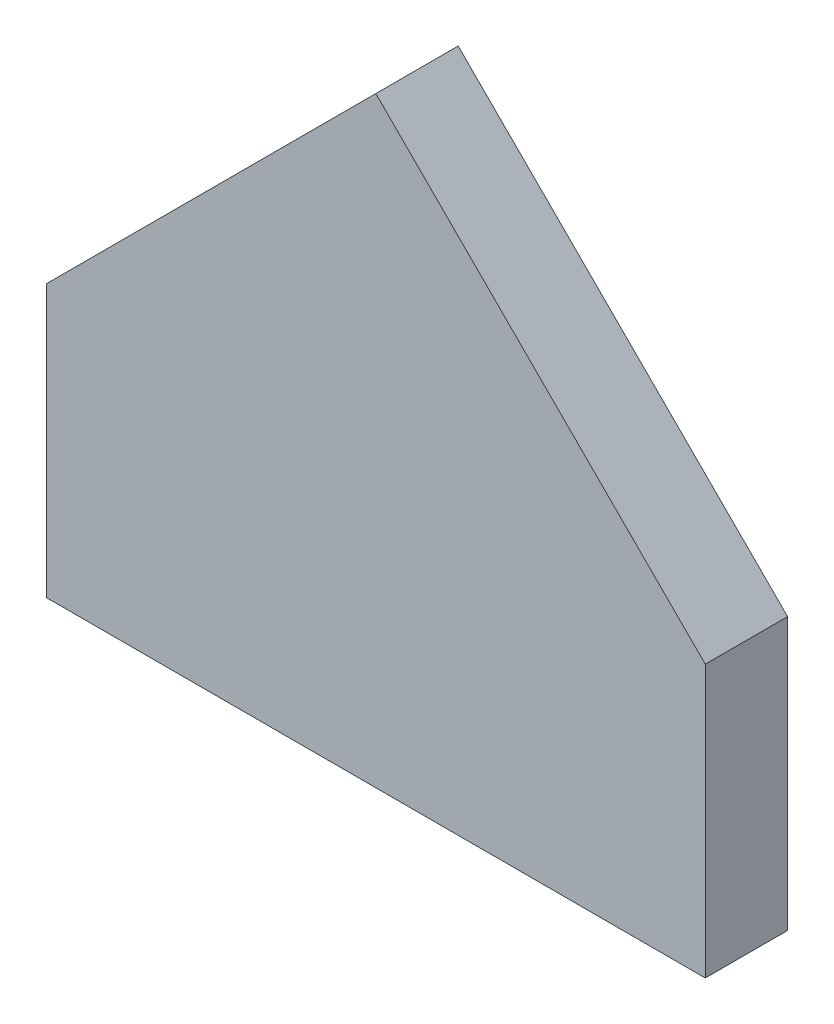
ISO-10303-21;
HEADER;
FILE_DESCRIPTION(('STEP AP214'),'2;1');
FILE_NAME('part.step','',(''),(''),'','','');
FILE_SCHEMA(('AUTOMOTIVE_DESIGN { 1 0 10303 214 1 1 1 1 }'));
ENDSEC;
DATA;
#1=APPLICATION_CONTEXT('core data for automotive mechanical design processes');
#2=APPLICATION_PROTOCOL_DEFINITION('international standard','automotive_design',2000,#1);
#3=PRODUCT_CONTEXT('',#1,'mechanical');
#4=PRODUCT('Part','Part','',(#3));
#5=PRODUCT_RELATED_PRODUCT_CATEGORY('part','',(#4));
#6=PRODUCT_DEFINITION_FORMATION('','',#4);
#7=PRODUCT_DEFINITION_CONTEXT('part definition',#1,'design');
#8=PRODUCT_DEFINITION('design','',#6,#7);
#9=PRODUCT_DEFINITION_SHAPE('','',#8);
#10=(LENGTH_UNIT() NAMED_UNIT(*) SI_UNIT(.MILLI.,.METRE.));
#11=(NAMED_UNIT(*) PLANE_ANGLE_UNIT() SI_UNIT($,.RADIAN.));
#12=(NAMED_UNIT(*) SI_UNIT($,.STERADIAN.) SOLID_ANGLE_UNIT());
#13=UNCERTAINTY_MEASURE_WITH_UNIT(LENGTH_MEASURE(1.E-05),#10,'distance_accuracy_value','');
#14=(GEOMETRIC_REPRESENTATION_CONTEXT(3) GLOBAL_UNCERTAINTY_ASSIGNED_CONTEXT((#13)) GLOBAL_UNIT_ASSIGNED_CONTEXT((#10,
#11,#12)) REPRESENTATION_CONTEXT('',''));
#15=CARTESIAN_POINT('',(0.,0.,0.));
#16=DIRECTION('',(0.,0.,1.));
#17=DIRECTION('',(1.,0.,0.));
#18=AXIS2_PLACEMENT_3D('',#15,#16,#17);
#19=CARTESIAN_POINT('',(0.,16.5,5.));
#20=DIRECTION('',(1.,0.,0.));
#21=DIRECTION('',(0.,1.,0.));
#22=AXIS2_PLACEMENT_3D('',#19,#20,#21);
#23=PLANE('',#22);
#24=DIRECTION('',(0.,-1.,0.));
#25=VECTOR('',#24,1.);
#26=CARTESIAN_POINT('',(0.,16.5,0.));
#27=LINE('',#26,#25);
#28=CARTESIAN_POINT('',(0.,16.5,0.));
#29=VERTEX_POINT('',#28);
#30=CARTESIAN_POINT('',(0.,0.,0.));
#31=VERTEX_POINT('',#30);
#32=EDGE_CURVE('E105',#29,#31,#27,.T.);
#33=ORIENTED_EDGE('',*,*,#32,.T.);
#34=DIRECTION('',(0.,0.,-1.));
#35=VECTOR('',#34,1.);
#36=CARTESIAN_POINT('',(0.,0.,5.));
#37=LINE('',#36,#35);
#38=CARTESIAN_POINT('',(0.,0.,5.));
#39=VERTEX_POINT('',#38);
#40=EDGE_CURVE('E11',#39,#31,#37,.T.);
#41=ORIENTED_EDGE('',*,*,#40,.F.);
#42=DIRECTION('',(0.,-1.,0.));
#43=VECTOR('',#42,1.);
#44=CARTESIAN_POINT('',(0.,16.5,5.));
#45=LINE('',#44,#43);
#46=CARTESIAN_POINT('',(0.,16.5,5.));
#47=VERTEX_POINT('',#46);
#48=EDGE_CURVE('E113',#47,#39,#45,.T.);
#49=ORIENTED_EDGE('',*,*,#48,.F.);
#50=DIRECTION('',(0.,0.,-1.));
#51=VECTOR('',#50,1.);
#52=CARTESIAN_POINT('',(0.,16.5,5.));
#53=LINE('',#52,#51);
#54=EDGE_CURVE('E101',#47,#29,#53,.T.);
#55=ORIENTED_EDGE('',*,*,#54,.T.);
#56=EDGE_LOOP('',(#33,#41,#49,#55));
#57=FACE_BOUND('',#56,.T.);
#58=ADVANCED_FACE('F31',(#57),#23,.F.);
#59=CARTESIAN_POINT('',(0.,0.,5.));
#60=DIRECTION('',(0.,1.,0.));
#61=DIRECTION('',(0.,0.,1.));
#62=AXIS2_PLACEMENT_3D('',#59,#60,#61);
#63=PLANE('',#62);
#64=DIRECTION('',(1.,0.,0.));
#65=VECTOR('',#64,1.);
#66=CARTESIAN_POINT('',(0.,0.,0.));
#67=LINE('',#66,#65);
#68=CARTESIAN_POINT('',(40.,0.,0.));
#69=VERTEX_POINT('',#68);
#70=EDGE_CURVE('E108',#31,#69,#67,.T.);
#71=ORIENTED_EDGE('',*,*,#70,.T.);
#72=DIRECTION('',(0.,0.,-1.));
#73=VECTOR('',#72,1.);
#74=CARTESIAN_POINT('',(40.,0.,5.));
#75=LINE('',#74,#73);
#76=CARTESIAN_POINT('',(40.,0.,5.));
#77=VERTEX_POINT('',#76);
#78=EDGE_CURVE('E39',#77,#69,#75,.T.);
#79=ORIENTED_EDGE('',*,*,#78,.F.);
#80=DIRECTION('',(1.,0.,0.));
#81=VECTOR('',#80,1.);
#82=CARTESIAN_POINT('',(0.,0.,5.));
#83=LINE('',#82,#81);
#84=EDGE_CURVE('E81',#39,#77,#83,.T.);
#85=ORIENTED_EDGE('',*,*,#84,.F.);
#86=ORIENTED_EDGE('',*,*,#40,.T.);
#87=EDGE_LOOP('',(#71,#79,#85,#86));
#88=FACE_BOUND('',#87,.T.);
#89=ADVANCED_FACE('F132',(#88),#63,.F.);
#90=CARTESIAN_POINT('',(40.,0.,5.));
#91=DIRECTION('',(-1.,0.,0.));
#92=DIRECTION('',(0.,0.,1.));
#93=AXIS2_PLACEMENT_3D('',#90,#91,#92);
#94=PLANE('',#93);
#95=DIRECTION('',(0.,1.,0.));
#96=VECTOR('',#95,1.);
#97=CARTESIAN_POINT('',(40.,0.,0.));
#98=LINE('',#97,#96);
#99=CARTESIAN_POINT('',(40.,16.5,0.));
#100=VERTEX_POINT('',#99);
#101=EDGE_CURVE('E96',#69,#100,#98,.T.);
#102=ORIENTED_EDGE('',*,*,#101,.T.);
#103=DIRECTION('',(0.,0.,-1.));
#104=VECTOR('',#103,1.);
#105=CARTESIAN_POINT('',(40.,16.5,5.));
#106=LINE('',#105,#104);
#107=CARTESIAN_POINT('',(40.,16.5,5.));
#108=VERTEX_POINT('',#107);
#109=EDGE_CURVE('E93',#108,#100,#106,.T.);
#110=ORIENTED_EDGE('',*,*,#109,.F.);
#111=DIRECTION('',(0.,1.,0.));
#112=VECTOR('',#111,1.);
#113=CARTESIAN_POINT('',(40.,0.,5.));
#114=LINE('',#113,#112);
#115=EDGE_CURVE('E85',#77,#108,#114,.T.);
#116=ORIENTED_EDGE('',*,*,#115,.F.);
#117=ORIENTED_EDGE('',*,*,#78,.T.);
#118=EDGE_LOOP('',(#102,#110,#116,#117));
#119=FACE_BOUND('',#118,.T.);
#120=ADVANCED_FACE('F94',(#119),#94,.F.);
#121=CARTESIAN_POINT('',(40.,16.5,5.));
#122=DIRECTION('',(-0.707106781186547,-0.707106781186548,0.));
#123=DIRECTION('',(0.707106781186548,-0.707106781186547,0.));
#124=AXIS2_PLACEMENT_3D('',#121,#122,#123);
#125=PLANE('',#124);
#126=DIRECTION('',(-0.707106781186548,0.707106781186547,0.));
#127=VECTOR('',#126,1.);
#128=CARTESIAN_POINT('',(40.,16.5,0.));
#129=LINE('',#128,#127);
#130=CARTESIAN_POINT('',(20.,36.5,0.));
#131=VERTEX_POINT('',#130);
#132=EDGE_CURVE('E67',#100,#131,#129,.T.);
#133=ORIENTED_EDGE('',*,*,#132,.T.);
#134=DIRECTION('',(0.,0.,-1.));
#135=VECTOR('',#134,1.);
#136=CARTESIAN_POINT('',(20.,36.5,5.));
#137=LINE('',#136,#135);
#138=CARTESIAN_POINT('',(20.,36.5,5.));
#139=VERTEX_POINT('',#138);
#140=EDGE_CURVE('E97',#139,#131,#137,.T.);
#141=ORIENTED_EDGE('',*,*,#140,.F.);
#142=DIRECTION('',(-0.707106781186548,0.707106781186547,0.));
#143=VECTOR('',#142,1.);
#144=CARTESIAN_POINT('',(40.,16.5,5.));
#145=LINE('',#144,#143);
#146=EDGE_CURVE('E89',#108,#139,#145,.T.);
#147=ORIENTED_EDGE('',*,*,#146,.F.);
#148=ORIENTED_EDGE('',*,*,#109,.T.);
#149=EDGE_LOOP('',(#133,#141,#147,#148));
#150=FACE_BOUND('',#149,.T.);
#151=ADVANCED_FACE('F99',(#150),#125,.F.);
#152=CARTESIAN_POINT('',(20.,36.5,5.));
#153=DIRECTION('',(0.707106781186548,-0.707106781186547,0.));
#154=DIRECTION('',(0.707106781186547,0.707106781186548,0.));
#155=AXIS2_PLACEMENT_3D('',#152,#153,#154);
#156=PLANE('',#155);
#157=DIRECTION('',(-0.707106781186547,-0.707106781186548,0.));
#158=VECTOR('',#157,1.);
#159=CARTESIAN_POINT('',(20.,36.5,0.));
#160=LINE('',#159,#158);
#161=EDGE_CURVE('E73',#131,#29,#160,.T.);
#162=ORIENTED_EDGE('',*,*,#161,.T.);
#163=ORIENTED_EDGE('',*,*,#54,.F.);
#164=DIRECTION('',(-0.707106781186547,-0.707106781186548,0.));
#165=VECTOR('',#164,1.);
#166=CARTESIAN_POINT('',(20.,36.5,5.));
#167=LINE('',#166,#165);
#168=EDGE_CURVE('E47',#139,#47,#167,.T.);
#169=ORIENTED_EDGE('',*,*,#168,.F.);
#170=ORIENTED_EDGE('',*,*,#140,.T.);
#171=EDGE_LOOP('',(#162,#163,#169,#170));
#172=FACE_BOUND('',#171,.T.);
#173=ADVANCED_FACE('F121',(#172),#156,.F.);
#174=CARTESIAN_POINT('',(0.,0.,5.));
#175=DIRECTION('',(0.,0.,1.));
#176=DIRECTION('',(1.,0.,0.));
#177=AXIS2_PLACEMENT_3D('',#174,#175,#176);
#178=PLANE('',#177);
#179=ORIENTED_EDGE('',*,*,#48,.T.);
#180=ORIENTED_EDGE('',*,*,#84,.T.);
#181=ORIENTED_EDGE('',*,*,#115,.T.);
#182=ORIENTED_EDGE('',*,*,#146,.T.);
#183=ORIENTED_EDGE('',*,*,#168,.T.);
#184=EDGE_LOOP('',(#179,#180,#181,#182,#183));
#185=FACE_BOUND('',#184,.T.);
#186=ADVANCED_FACE('F87',(#185),#178,.T.);
#187=CARTESIAN_POINT('',(0.,0.,0.));
#188=DIRECTION('',(0.,0.,1.));
#189=DIRECTION('',(1.,0.,0.));
#190=AXIS2_PLACEMENT_3D('',#187,#188,#189);
#191=PLANE('',#190);
#192=ORIENTED_EDGE('',*,*,#32,.F.);
#193=ORIENTED_EDGE('',*,*,#161,.F.);
#194=ORIENTED_EDGE('',*,*,#132,.F.);
#195=ORIENTED_EDGE('',*,*,#101,.F.);
#196=ORIENTED_EDGE('',*,*,#70,.F.);
#197=EDGE_LOOP('',(#192,#193,#194,#195,#196));
#198=FACE_BOUND('',#197,.T.);
#199=ADVANCED_FACE('F117',(#198),#191,.F.);
#200=CLOSED_SHELL('',(#58,#89,#120,#151,#173,#186,#199));
#201=MANIFOLD_SOLID_BREP('B2',#200);
#202=ADVANCED_BREP_SHAPE_REPRESENTATION('',(#18,#201),#14);
#203=SHAPE_DEFINITION_REPRESENTATION(#9,#202);
ENDSEC;
END-ISO-10303-21;
